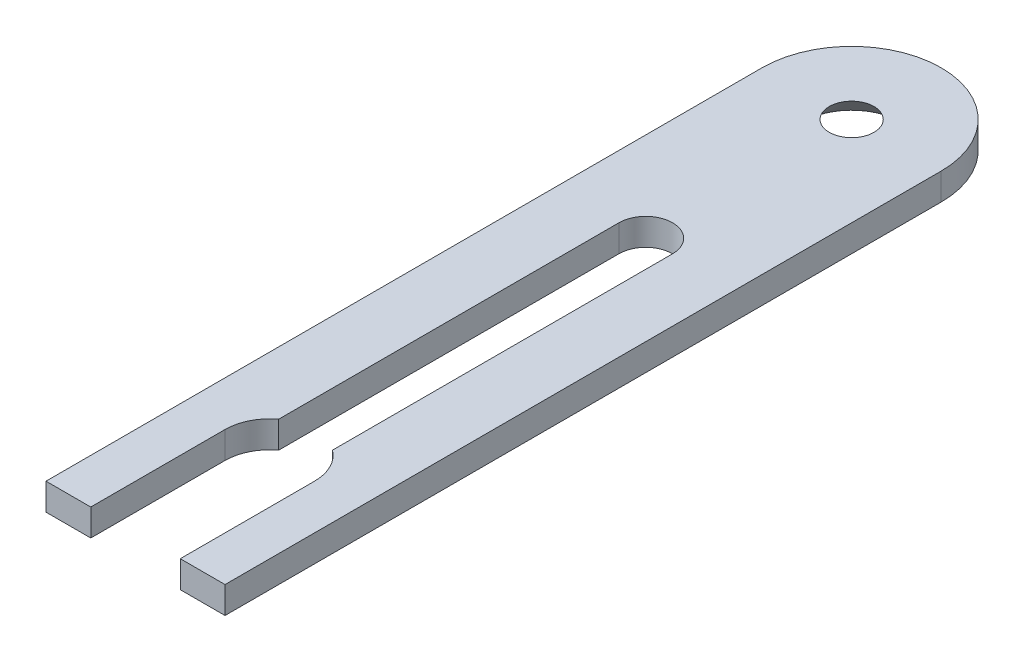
from build123d import *

# Parameters (mm, degrees)
SKETCH1_R      = 2.5
EXTRUDE1_DEPTH = 3
DRAFT1_ANGLE   = -45


with BuildPart() as part:
    # Sketch1 → Extrude1 (new body)
    with BuildSketch(Plane(origin=(0, 0, 0), x_dir=(1, 0, 0), z_dir=(0, 1, 0))):
        with BuildLine():
            Line((15, 0), (20, 0))
            Line((20, 0), (20, 80))
            ThreePointArc((20, 80), (10, 90), (0, 80))
            Line((0, 80), (0, 0))
            Line((0, 0), (5, 0))
            Line((5, 0), (5, 15))
            ThreePointArc((5, 15), (5.527864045, 17.236067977), (7, 19))
            Line((7, 19), (7, 57))
            ThreePointArc((7, 57), (10, 60), (13, 57))
            Line((13, 57), (13, 19))
            ThreePointArc((13, 19), (14.472135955, 17.236067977), (15, 15))
            Line((15, 15), (15, 0))
        make_face()
        with Locations(Location((10, 80, 0), (0, 0, 270))):
            Circle(SKETCH1_R, mode=Mode.SUBTRACT)
    extrude(amount=EXTRUDE1_DEPTH)

    # Draft1
    draft1_faces = [part.faces().sort_by_distance(p)[0] for p in [
        (10, 1.5, -82.5),
    ]]
    draft(draft1_faces, Plane(origin=(10, 3, -80), x_dir=(0, 0, 1), z_dir=(0, 1, 0)), DRAFT1_ANGLE)


solid = part.part
